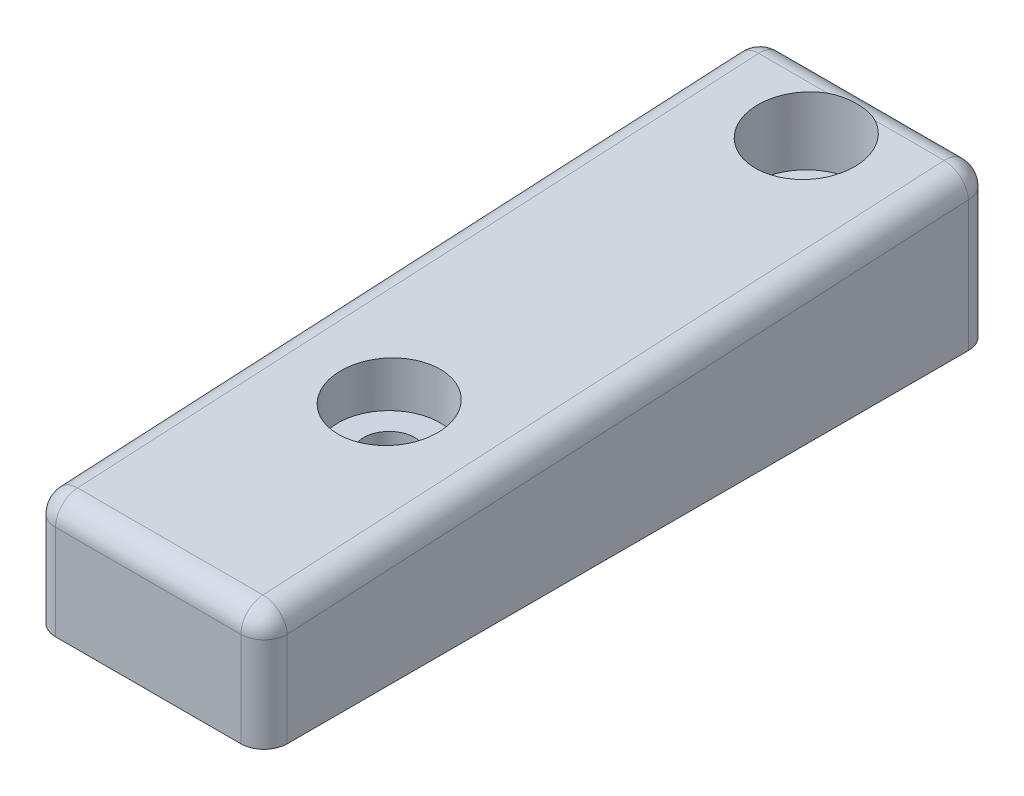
from build123d import *

# Parameters (mm, degrees)
EXTRUSION1_DEPTH = 50
CONG_1_R         = 5
CONG_2_R         = 5
ESQUISSE2_R      = 11
EXTRUSION3_DEPTH = 43
ESQUISSE3_R      = 5.5
EXTRUSION4_DEPTH = 43


with BuildPart() as part:
    # Esquisse1 → Extrusion1 (new body)
    with BuildSketch(Plane(origin=(0, 0, 0), x_dir=(0, 0, -1), z_dir=(1, 0, 0))):
        Polygon((0, 0), (0, 25.21), (157, 33.438021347), (157, 0), align=None)
    extrude(amount=EXTRUSION1_DEPTH)

    # Cong_1
    cong_1_edges = [part.edges().sort_by_distance(p)[0] for p in [
        (25, 25.21, 0),
        (25, 33.438021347, -157),
    ]]
    fillet(cong_1_edges, radius=CONG_1_R)

    # Cong_2
    cong_2_edges = [part.edges().sort_by_distance(p)[0] for p in [
        (0, 29.310296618, -78.238320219),
        (50, 29.310296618, -78.238320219),
        (0, 10.232588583, 0),
        (0, 23.906950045, -1.373128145),
        (0, 31.795992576, -155.441772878),
        (50, 10.232588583, 0),
        (50, 23.906950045, -1.373128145),
        (50, 31.795992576, -155.441772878),
        (0, 14.084560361, -157),
        (50, 14.084560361, -157),
    ]]
    fillet(cong_2_edges, radius=CONG_2_R)

    # Esquisse2 → Extrusion3 (cut)
    with BuildSketch(Plane(origin=(0, 18.5, 1.143681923), x_dir=(1, 0, 0), z_dir=(0, 1, 0))):
        with Locations(Location((25, 143.143681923, 0), (0, 0, 117.711311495))):
            Circle(ESQUISSE2_R)
        with Locations(Location((25, 53.143681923, 0), (0, 0, 270))):
            Circle(ESQUISSE2_R)
    extrude(amount=EXTRUSION3_DEPTH, mode=Mode.SUBTRACT)

    # Esquisse3 → Extrusion4 (cut)
    with BuildSketch(Plane(origin=(0, 18.5, 0), x_dir=(1, 0, 0), z_dir=(0, 1, 0))):
        with Locations(Location((25, 52, 0), (0, 0, 270))):
            Circle(ESQUISSE3_R)
        with Locations(Location((25, 142, 0), (0, 0, 270))):
            Circle(ESQUISSE3_R)
    extrude(amount=-EXTRUSION4_DEPTH, mode=Mode.SUBTRACT)


solid = part.part
